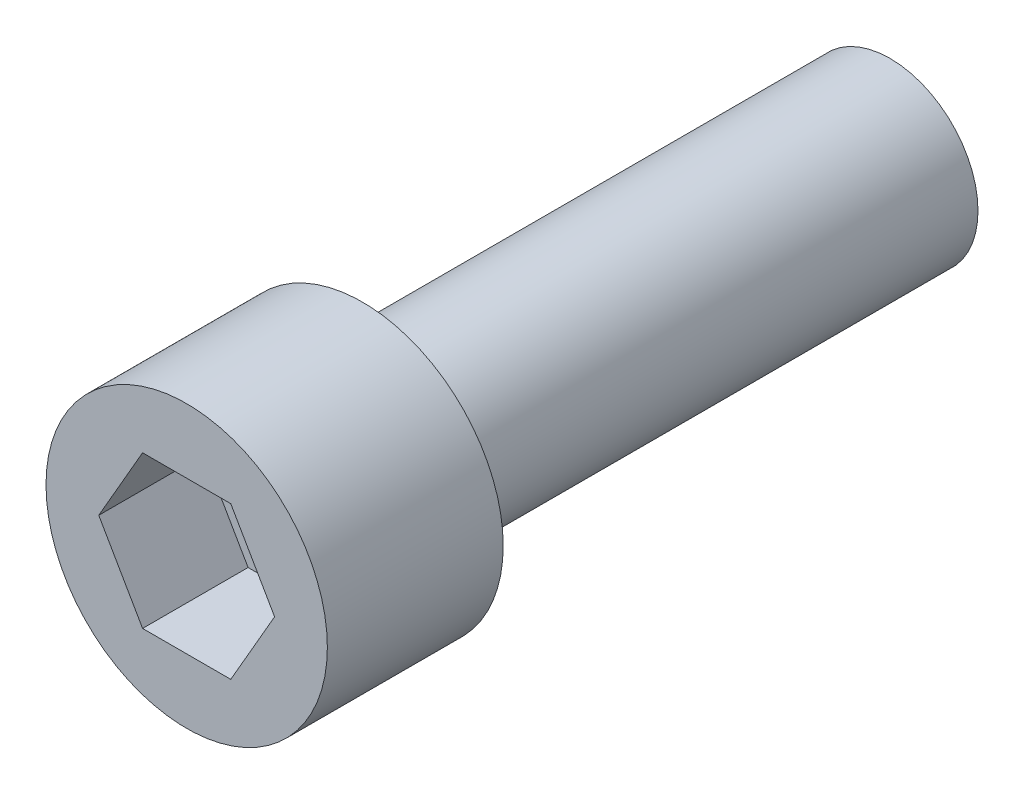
ISO-10303-21;
HEADER;
FILE_DESCRIPTION(('STEP AP214'),'2;1');
FILE_NAME('part.step','',(''),(''),'','','');
FILE_SCHEMA(('AUTOMOTIVE_DESIGN { 1 0 10303 214 1 1 1 1 }'));
ENDSEC;
DATA;
#1=APPLICATION_CONTEXT('core data for automotive mechanical design processes');
#2=APPLICATION_PROTOCOL_DEFINITION('international standard','automotive_design',2000,#1);
#3=PRODUCT_CONTEXT('',#1,'mechanical');
#4=PRODUCT('Part','Part','',(#3));
#5=PRODUCT_RELATED_PRODUCT_CATEGORY('part','',(#4));
#6=PRODUCT_DEFINITION_FORMATION('','',#4);
#7=PRODUCT_DEFINITION_CONTEXT('part definition',#1,'design');
#8=PRODUCT_DEFINITION('design','',#6,#7);
#9=PRODUCT_DEFINITION_SHAPE('','',#8);
#10=(LENGTH_UNIT() NAMED_UNIT(*) SI_UNIT(.MILLI.,.METRE.));
#11=(NAMED_UNIT(*) PLANE_ANGLE_UNIT() SI_UNIT($,.RADIAN.));
#12=(NAMED_UNIT(*) SI_UNIT($,.STERADIAN.) SOLID_ANGLE_UNIT());
#13=UNCERTAINTY_MEASURE_WITH_UNIT(LENGTH_MEASURE(1.E-05),#10,'distance_accuracy_value','');
#14=(GEOMETRIC_REPRESENTATION_CONTEXT(3) GLOBAL_UNCERTAINTY_ASSIGNED_CONTEXT((#13)) GLOBAL_UNIT_ASSIGNED_CONTEXT((#10,
#11,#12)) REPRESENTATION_CONTEXT('',''));
#15=CARTESIAN_POINT('',(0.,0.,0.));
#16=DIRECTION('',(0.,0.,1.));
#17=DIRECTION('',(1.,0.,0.));
#18=AXIS2_PLACEMENT_3D('',#15,#16,#17);
#19=CARTESIAN_POINT('',(0.,0.,0.));
#20=DIRECTION('',(0.,0.,1.));
#21=DIRECTION('',(1.,0.,0.));
#22=AXIS2_PLACEMENT_3D('',#19,#20,#21);
#23=PLANE('',#22);
#24=CARTESIAN_POINT('',(0.,0.,0.));
#25=DIRECTION('',(0.,0.,1.));
#26=DIRECTION('',(1.,0.,0.));
#27=AXIS2_PLACEMENT_3D('',#24,#25,#26);
#28=CIRCLE('',#27,4.);
#29=CARTESIAN_POINT('',(4.,0.,0.));
#30=VERTEX_POINT('',#29);
#31=EDGE_CURVE('E88',#30,#30,#28,.T.);
#32=ORIENTED_EDGE('',*,*,#31,.F.);
#33=EDGE_LOOP('',(#32));
#34=FACE_BOUND('',#33,.T.);
#35=CARTESIAN_POINT('',(0.,0.,0.));
#36=DIRECTION('',(0.,0.,-1.));
#37=DIRECTION('',(-1.,0.,0.));
#38=AXIS2_PLACEMENT_3D('',#35,#36,#37);
#39=CIRCLE('',#38,2.5);
#40=CARTESIAN_POINT('',(-2.5,0.,0.));
#41=VERTEX_POINT('',#40);
#42=EDGE_CURVE('E11',#41,#41,#39,.T.);
#43=ORIENTED_EDGE('',*,*,#42,.F.);
#44=EDGE_LOOP('',(#43));
#45=FACE_BOUND('',#44,.T.);
#46=ADVANCED_FACE('F31',(#34,#45),#23,.F.);
#47=CARTESIAN_POINT('',(0.,0.,5.));
#48=DIRECTION('',(0.,0.,1.));
#49=DIRECTION('',(1.,0.,0.));
#50=AXIS2_PLACEMENT_3D('',#47,#48,#49);
#51=PLANE('',#50);
#52=CARTESIAN_POINT('',(0.,0.,5.));
#53=DIRECTION('',(0.,0.,1.));
#54=DIRECTION('',(1.,0.,0.));
#55=AXIS2_PLACEMENT_3D('',#52,#53,#54);
#56=CIRCLE('',#55,4.);
#57=CARTESIAN_POINT('',(4.,0.,5.));
#58=VERTEX_POINT('',#57);
#59=EDGE_CURVE('E35',#58,#58,#56,.T.);
#60=ORIENTED_EDGE('',*,*,#59,.T.);
#61=EDGE_LOOP('',(#60));
#62=FACE_BOUND('',#61,.T.);
#63=DIRECTION('',(-1.,0.,0.));
#64=VECTOR('',#63,1.);
#65=CARTESIAN_POINT('',(1.25363455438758,-2.16296102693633,5.));
#66=LINE('',#65,#64);
#67=CARTESIAN_POINT('',(1.25363455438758,-2.16296102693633,5.));
#68=VERTEX_POINT('',#67);
#69=CARTESIAN_POINT('',(-1.25363455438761,-2.16296102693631,5.));
#70=VERTEX_POINT('',#69);
#71=EDGE_CURVE('E103',#68,#70,#66,.T.);
#72=ORIENTED_EDGE('',*,*,#71,.T.);
#73=DIRECTION('',(-0.499272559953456,0.866444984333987,0.));
#74=VECTOR('',#73,1.);
#75=CARTESIAN_POINT('',(-1.25363455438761,-2.16296102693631,5.));
#76=LINE('',#75,#74);
#77=CARTESIAN_POINT('',(-2.5,0.,5.));
#78=VERTEX_POINT('',#77);
#79=EDGE_CURVE('E47',#70,#78,#76,.T.);
#80=ORIENTED_EDGE('',*,*,#79,.T.);
#81=DIRECTION('',(0.499272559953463,0.866444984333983,0.));
#82=VECTOR('',#81,1.);
#83=CARTESIAN_POINT('',(-2.5,0.,5.));
#84=LINE('',#83,#82);
#85=CARTESIAN_POINT('',(-1.25363455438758,2.16296102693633,5.));
#86=VERTEX_POINT('',#85);
#87=EDGE_CURVE('E92',#78,#86,#84,.T.);
#88=ORIENTED_EDGE('',*,*,#87,.T.);
#89=DIRECTION('',(1.,0.,0.));
#90=VECTOR('',#89,1.);
#91=CARTESIAN_POINT('',(-1.25363455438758,2.16296102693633,5.));
#92=LINE('',#91,#90);
#93=CARTESIAN_POINT('',(1.25363455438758,2.16296102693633,5.));
#94=VERTEX_POINT('',#93);
#95=EDGE_CURVE('E97',#86,#94,#92,.T.);
#96=ORIENTED_EDGE('',*,*,#95,.T.);
#97=DIRECTION('',(0.499272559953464,-0.866444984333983,0.));
#98=VECTOR('',#97,1.);
#99=CARTESIAN_POINT('',(1.25363455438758,2.16296102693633,5.));
#100=LINE('',#99,#98);
#101=CARTESIAN_POINT('',(2.5,0.,5.));
#102=VERTEX_POINT('',#101);
#103=EDGE_CURVE('E110',#94,#102,#100,.T.);
#104=ORIENTED_EDGE('',*,*,#103,.T.);
#105=DIRECTION('',(-0.499272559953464,-0.866444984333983,0.));
#106=VECTOR('',#105,1.);
#107=CARTESIAN_POINT('',(2.5,0.,5.));
#108=LINE('',#107,#106);
#109=EDGE_CURVE('E113',#102,#68,#108,.T.);
#110=ORIENTED_EDGE('',*,*,#109,.T.);
#111=EDGE_LOOP('',(#72,#80,#88,#96,#104,#110));
#112=FACE_BOUND('',#111,.T.);
#113=ADVANCED_FACE('F100',(#62,#112),#51,.T.);
#114=CARTESIAN_POINT('',(0.,0.,5.));
#115=DIRECTION('',(0.,0.,-1.));
#116=DIRECTION('',(-1.,0.,0.));
#117=AXIS2_PLACEMENT_3D('',#114,#115,#116);
#118=CYLINDRICAL_SURFACE('',#117,4.);
#119=ORIENTED_EDGE('',*,*,#59,.F.);
#120=EDGE_LOOP('',(#119));
#121=FACE_BOUND('',#120,.T.);
#122=ORIENTED_EDGE('',*,*,#31,.T.);
#123=EDGE_LOOP('',(#122));
#124=FACE_BOUND('',#123,.T.);
#125=ADVANCED_FACE('F33',(#121,#124),#118,.T.);
#126=CARTESIAN_POINT('',(-1.25363455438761,-2.16296102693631,2.));
#127=DIRECTION('',(0.866444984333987,0.499272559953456,0.));
#128=DIRECTION('',(-0.499272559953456,0.866444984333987,0.));
#129=AXIS2_PLACEMENT_3D('',#126,#127,#128);
#130=PLANE('',#129);
#131=DIRECTION('',(0.,0.,1.));
#132=VECTOR('',#131,1.);
#133=CARTESIAN_POINT('',(-2.5,0.,2.));
#134=LINE('',#133,#132);
#135=CARTESIAN_POINT('',(-2.5,0.,2.));
#136=VERTEX_POINT('',#135);
#137=EDGE_CURVE('E81',#136,#78,#134,.T.);
#138=ORIENTED_EDGE('',*,*,#137,.T.);
#139=ORIENTED_EDGE('',*,*,#79,.F.);
#140=DIRECTION('',(0.,0.,1.));
#141=VECTOR('',#140,1.);
#142=CARTESIAN_POINT('',(-1.25363455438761,-2.16296102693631,2.));
#143=LINE('',#142,#141);
#144=CARTESIAN_POINT('',(-1.25363455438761,-2.16296102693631,2.));
#145=VERTEX_POINT('',#144);
#146=EDGE_CURVE('E51',#145,#70,#143,.T.);
#147=ORIENTED_EDGE('',*,*,#146,.F.);
#148=DIRECTION('',(-0.499272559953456,0.866444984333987,0.));
#149=VECTOR('',#148,1.);
#150=CARTESIAN_POINT('',(-1.25363455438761,-2.16296102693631,2.));
#151=LINE('',#150,#149);
#152=EDGE_CURVE('E84',#145,#136,#151,.T.);
#153=ORIENTED_EDGE('',*,*,#152,.T.);
#154=EDGE_LOOP('',(#138,#139,#147,#153));
#155=FACE_BOUND('',#154,.T.);
#156=ADVANCED_FACE('F83',(#155),#130,.T.);
#157=CARTESIAN_POINT('',(-2.5,0.,2.));
#158=DIRECTION('',(0.866444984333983,-0.499272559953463,0.));
#159=DIRECTION('',(0.499272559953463,0.866444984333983,0.));
#160=AXIS2_PLACEMENT_3D('',#157,#158,#159);
#161=PLANE('',#160);
#162=DIRECTION('',(0.,0.,1.));
#163=VECTOR('',#162,1.);
#164=CARTESIAN_POINT('',(-1.25363455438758,2.16296102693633,2.));
#165=LINE('',#164,#163);
#166=CARTESIAN_POINT('',(-1.25363455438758,2.16296102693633,2.));
#167=VERTEX_POINT('',#166);
#168=EDGE_CURVE('E89',#167,#86,#165,.T.);
#169=ORIENTED_EDGE('',*,*,#168,.T.);
#170=ORIENTED_EDGE('',*,*,#87,.F.);
#171=ORIENTED_EDGE('',*,*,#137,.F.);
#172=DIRECTION('',(0.499272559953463,0.866444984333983,0.));
#173=VECTOR('',#172,1.);
#174=CARTESIAN_POINT('',(-2.5,0.,2.));
#175=LINE('',#174,#173);
#176=EDGE_CURVE('E117',#136,#167,#175,.T.);
#177=ORIENTED_EDGE('',*,*,#176,.T.);
#178=EDGE_LOOP('',(#169,#170,#171,#177));
#179=FACE_BOUND('',#178,.T.);
#180=ADVANCED_FACE('F93',(#179),#161,.T.);
#181=CARTESIAN_POINT('',(-1.25363455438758,2.16296102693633,2.));
#182=DIRECTION('',(0.,-1.,0.));
#183=DIRECTION('',(0.,0.,-1.));
#184=AXIS2_PLACEMENT_3D('',#181,#182,#183);
#185=PLANE('',#184);
#186=DIRECTION('',(0.,0.,1.));
#187=VECTOR('',#186,1.);
#188=CARTESIAN_POINT('',(1.25363455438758,2.16296102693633,2.));
#189=LINE('',#188,#187);
#190=CARTESIAN_POINT('',(1.25363455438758,2.16296102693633,2.));
#191=VERTEX_POINT('',#190);
#192=EDGE_CURVE('E136',#191,#94,#189,.T.);
#193=ORIENTED_EDGE('',*,*,#192,.T.);
#194=ORIENTED_EDGE('',*,*,#95,.F.);
#195=ORIENTED_EDGE('',*,*,#168,.F.);
#196=DIRECTION('',(1.,0.,0.));
#197=VECTOR('',#196,1.);
#198=CARTESIAN_POINT('',(-1.25363455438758,2.16296102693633,2.));
#199=LINE('',#198,#197);
#200=EDGE_CURVE('E119',#167,#191,#199,.T.);
#201=ORIENTED_EDGE('',*,*,#200,.T.);
#202=EDGE_LOOP('',(#193,#194,#195,#201));
#203=FACE_BOUND('',#202,.T.);
#204=ADVANCED_FACE('F160',(#203),#185,.T.);
#205=CARTESIAN_POINT('',(1.25363455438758,2.16296102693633,2.));
#206=DIRECTION('',(-0.866444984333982,-0.499272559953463,0.));
#207=DIRECTION('',(0.499272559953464,-0.866444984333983,0.));
#208=AXIS2_PLACEMENT_3D('',#205,#206,#207);
#209=PLANE('',#208);
#210=DIRECTION('',(0.,0.,1.));
#211=VECTOR('',#210,1.);
#212=CARTESIAN_POINT('',(2.5,0.,2.));
#213=LINE('',#212,#211);
#214=CARTESIAN_POINT('',(2.5,0.,2.));
#215=VERTEX_POINT('',#214);
#216=EDGE_CURVE('E134',#215,#102,#213,.T.);
#217=ORIENTED_EDGE('',*,*,#216,.T.);
#218=ORIENTED_EDGE('',*,*,#103,.F.);
#219=ORIENTED_EDGE('',*,*,#192,.F.);
#220=DIRECTION('',(0.499272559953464,-0.866444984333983,0.));
#221=VECTOR('',#220,1.);
#222=CARTESIAN_POINT('',(1.25363455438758,2.16296102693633,2.));
#223=LINE('',#222,#221);
#224=EDGE_CURVE('E122',#191,#215,#223,.T.);
#225=ORIENTED_EDGE('',*,*,#224,.T.);
#226=EDGE_LOOP('',(#217,#218,#219,#225));
#227=FACE_BOUND('',#226,.T.);
#228=ADVANCED_FACE('F163',(#227),#209,.T.);
#229=CARTESIAN_POINT('',(2.5,0.,2.));
#230=DIRECTION('',(-0.866444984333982,0.499272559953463,0.));
#231=DIRECTION('',(-0.499272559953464,-0.866444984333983,0.));
#232=AXIS2_PLACEMENT_3D('',#229,#230,#231);
#233=PLANE('',#232);
#234=DIRECTION('',(0.,0.,1.));
#235=VECTOR('',#234,1.);
#236=CARTESIAN_POINT('',(1.25363455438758,-2.16296102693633,2.));
#237=LINE('',#236,#235);
#238=CARTESIAN_POINT('',(1.25363455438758,-2.16296102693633,2.));
#239=VERTEX_POINT('',#238);
#240=EDGE_CURVE('E132',#239,#68,#237,.T.);
#241=ORIENTED_EDGE('',*,*,#240,.T.);
#242=ORIENTED_EDGE('',*,*,#109,.F.);
#243=ORIENTED_EDGE('',*,*,#216,.F.);
#244=DIRECTION('',(-0.499272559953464,-0.866444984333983,0.));
#245=VECTOR('',#244,1.);
#246=CARTESIAN_POINT('',(2.5,0.,2.));
#247=LINE('',#246,#245);
#248=EDGE_CURVE('E125',#215,#239,#247,.T.);
#249=ORIENTED_EDGE('',*,*,#248,.T.);
#250=EDGE_LOOP('',(#241,#242,#243,#249));
#251=FACE_BOUND('',#250,.T.);
#252=ADVANCED_FACE('F167',(#251),#233,.T.);
#253=CARTESIAN_POINT('',(1.25363455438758,-2.16296102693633,2.));
#254=DIRECTION('',(0.,1.,0.));
#255=DIRECTION('',(-1.,0.,0.));
#256=AXIS2_PLACEMENT_3D('',#253,#254,#255);
#257=PLANE('',#256);
#258=DIRECTION('',(-1.,0.,0.));
#259=VECTOR('',#258,1.);
#260=CARTESIAN_POINT('',(1.25363455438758,-2.16296102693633,2.));
#261=LINE('',#260,#259);
#262=EDGE_CURVE('E128',#239,#145,#261,.T.);
#263=ORIENTED_EDGE('',*,*,#262,.T.);
#264=ORIENTED_EDGE('',*,*,#146,.T.);
#265=ORIENTED_EDGE('',*,*,#71,.F.);
#266=ORIENTED_EDGE('',*,*,#240,.F.);
#267=EDGE_LOOP('',(#263,#264,#265,#266));
#268=FACE_BOUND('',#267,.T.);
#269=ADVANCED_FACE('F171',(#268),#257,.T.);
#270=CARTESIAN_POINT('',(-3.7463654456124,2.16296102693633,2.));
#271=DIRECTION('',(0.,0.,-1.));
#272=DIRECTION('',(-1.,0.,0.));
#273=AXIS2_PLACEMENT_3D('',#270,#271,#272);
#274=PLANE('',#273);
#275=ORIENTED_EDGE('',*,*,#152,.F.);
#276=ORIENTED_EDGE('',*,*,#262,.F.);
#277=ORIENTED_EDGE('',*,*,#248,.F.);
#278=ORIENTED_EDGE('',*,*,#224,.F.);
#279=ORIENTED_EDGE('',*,*,#200,.F.);
#280=ORIENTED_EDGE('',*,*,#176,.F.);
#281=EDGE_LOOP('',(#275,#276,#277,#278,#279,#280));
#282=FACE_BOUND('',#281,.T.);
#283=ADVANCED_FACE('F173',(#282),#274,.F.);
#284=CARTESIAN_POINT('',(0.,0.,-15.));
#285=DIRECTION('',(0.,0.,1.));
#286=DIRECTION('',(1.,0.,0.));
#287=AXIS2_PLACEMENT_3D('',#284,#285,#286);
#288=CYLINDRICAL_SURFACE('',#287,2.5);
#289=CARTESIAN_POINT('',(0.,0.,-15.));
#290=DIRECTION('',(0.,0.,-1.));
#291=DIRECTION('',(-1.,0.,0.));
#292=AXIS2_PLACEMENT_3D('',#289,#290,#291);
#293=CIRCLE('',#292,2.5);
#294=CARTESIAN_POINT('',(-2.5,0.,-15.));
#295=VERTEX_POINT('',#294);
#296=EDGE_CURVE('E104',#295,#295,#293,.T.);
#297=ORIENTED_EDGE('',*,*,#296,.F.);
#298=EDGE_LOOP('',(#297));
#299=FACE_BOUND('',#298,.T.);
#300=ORIENTED_EDGE('',*,*,#42,.T.);
#301=EDGE_LOOP('',(#300));
#302=FACE_BOUND('',#301,.T.);
#303=ADVANCED_FACE('F180',(#299,#302),#288,.T.);
#304=CARTESIAN_POINT('',(0.,0.,-15.));
#305=DIRECTION('',(0.,0.,-1.));
#306=DIRECTION('',(-1.,0.,0.));
#307=AXIS2_PLACEMENT_3D('',#304,#305,#306);
#308=PLANE('',#307);
#309=ORIENTED_EDGE('',*,*,#296,.T.);
#310=EDGE_LOOP('',(#309));
#311=FACE_BOUND('',#310,.T.);
#312=ADVANCED_FACE('F176',(#311),#308,.T.);
#313=CLOSED_SHELL('',(#46,#113,#125,#156,#180,#204,#228,#252,#269,#283,#303,#312));
#314=MANIFOLD_SOLID_BREP('B2',#313);
#315=ADVANCED_BREP_SHAPE_REPRESENTATION('',(#18,#314),#14);
#316=SHAPE_DEFINITION_REPRESENTATION(#9,#315);
ENDSEC;
END-ISO-10303-21;
